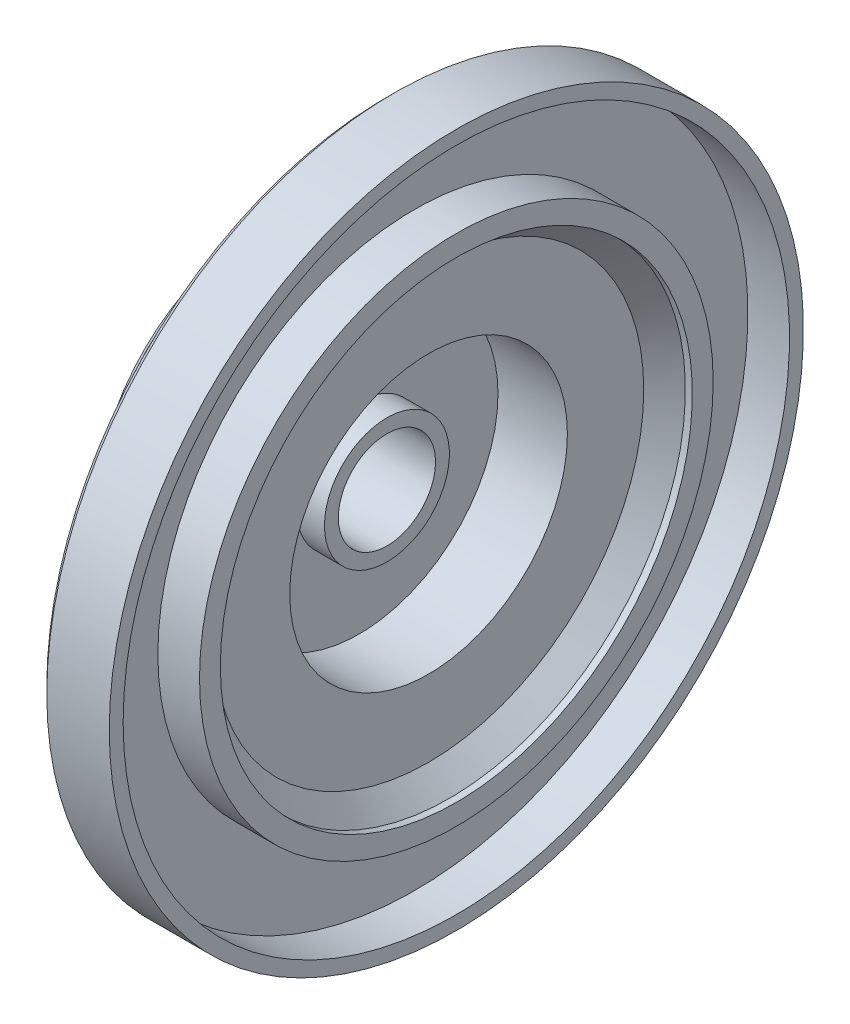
ISO-10303-21;
HEADER;
FILE_DESCRIPTION(('STEP AP214'),'2;1');
FILE_NAME('part.step','',(''),(''),'','','');
FILE_SCHEMA(('AUTOMOTIVE_DESIGN { 1 0 10303 214 1 1 1 1 }'));
ENDSEC;
DATA;
#1=APPLICATION_CONTEXT('core data for automotive mechanical design processes');
#2=APPLICATION_PROTOCOL_DEFINITION('international standard','automotive_design',2000,#1);
#3=PRODUCT_CONTEXT('',#1,'mechanical');
#4=PRODUCT('Part','Part','',(#3));
#5=PRODUCT_RELATED_PRODUCT_CATEGORY('part','',(#4));
#6=PRODUCT_DEFINITION_FORMATION('','',#4);
#7=PRODUCT_DEFINITION_CONTEXT('part definition',#1,'design');
#8=PRODUCT_DEFINITION('design','',#6,#7);
#9=PRODUCT_DEFINITION_SHAPE('','',#8);
#10=(LENGTH_UNIT() NAMED_UNIT(*) SI_UNIT(.MILLI.,.METRE.));
#11=(NAMED_UNIT(*) PLANE_ANGLE_UNIT() SI_UNIT($,.RADIAN.));
#12=(NAMED_UNIT(*) SI_UNIT($,.STERADIAN.) SOLID_ANGLE_UNIT());
#13=UNCERTAINTY_MEASURE_WITH_UNIT(LENGTH_MEASURE(1.E-05),#10,'distance_accuracy_value','');
#14=(GEOMETRIC_REPRESENTATION_CONTEXT(3) GLOBAL_UNCERTAINTY_ASSIGNED_CONTEXT((#13)) GLOBAL_UNIT_ASSIGNED_CONTEXT((#10,
#11,#12)) REPRESENTATION_CONTEXT('',''));
#15=CARTESIAN_POINT('',(0.,0.,0.));
#16=DIRECTION('',(0.,0.,1.));
#17=DIRECTION('',(1.,0.,0.));
#18=AXIS2_PLACEMENT_3D('',#15,#16,#17);
#19=CARTESIAN_POINT('',(0.,0.,0.));
#20=DIRECTION('',(-1.,0.,0.));
#21=DIRECTION('',(0.,0.,1.));
#22=AXIS2_PLACEMENT_3D('',#19,#20,#21);
#23=CYLINDRICAL_SURFACE('',#22,3.5);
#24=CARTESIAN_POINT('',(-17.,0.,0.));
#25=DIRECTION('',(-1.,0.,0.));
#26=DIRECTION('',(0.,0.,1.));
#27=AXIS2_PLACEMENT_3D('',#24,#25,#26);
#28=CIRCLE('',#27,3.5);
#29=CARTESIAN_POINT('',(-17.,0.,3.5));
#30=VERTEX_POINT('',#29);
#31=EDGE_CURVE('E235',#30,#30,#28,.T.);
#32=ORIENTED_EDGE('',*,*,#31,.T.);
#33=EDGE_LOOP('',(#32));
#34=FACE_BOUND('',#33,.T.);
#35=CARTESIAN_POINT('',(-5.,0.,0.));
#36=DIRECTION('',(-1.,0.,0.));
#37=DIRECTION('',(0.,0.,1.));
#38=AXIS2_PLACEMENT_3D('',#35,#36,#37);
#39=CIRCLE('',#38,3.5);
#40=CARTESIAN_POINT('',(-5.,0.,3.5));
#41=VERTEX_POINT('',#40);
#42=EDGE_CURVE('E304',#41,#41,#39,.T.);
#43=ORIENTED_EDGE('',*,*,#42,.F.);
#44=EDGE_LOOP('',(#43));
#45=FACE_BOUND('',#44,.T.);
#46=ADVANCED_FACE('F31',(#34,#45),#23,.F.);
#47=CARTESIAN_POINT('',(-5.,4.5,0.));
#48=DIRECTION('',(1.,0.,0.));
#49=DIRECTION('',(0.,0.,-1.));
#50=AXIS2_PLACEMENT_3D('',#47,#48,#49);
#51=PLANE('',#50);
#52=ORIENTED_EDGE('',*,*,#42,.T.);
#53=EDGE_LOOP('',(#52));
#54=FACE_BOUND('',#53,.T.);
#55=CARTESIAN_POINT('',(-5.,0.,0.));
#56=DIRECTION('',(-1.,0.,0.));
#57=DIRECTION('',(0.,0.,1.));
#58=AXIS2_PLACEMENT_3D('',#55,#56,#57);
#59=CIRCLE('',#58,4.5);
#60=CARTESIAN_POINT('',(-5.,0.,4.5));
#61=VERTEX_POINT('',#60);
#62=EDGE_CURVE('E301',#61,#61,#59,.T.);
#63=ORIENTED_EDGE('',*,*,#62,.F.);
#64=EDGE_LOOP('',(#63));
#65=FACE_BOUND('',#64,.T.);
#66=ADVANCED_FACE('F406',(#54,#65),#51,.T.);
#67=CARTESIAN_POINT('',(0.,0.,0.));
#68=DIRECTION('',(-1.,0.,0.));
#69=DIRECTION('',(0.,0.,1.));
#70=AXIS2_PLACEMENT_3D('',#67,#68,#69);
#71=CYLINDRICAL_SURFACE('',#70,4.5);
#72=CARTESIAN_POINT('',(-7.,0.,0.));
#73=DIRECTION('',(-1.,0.,0.));
#74=DIRECTION('',(0.,0.,1.));
#75=AXIS2_PLACEMENT_3D('',#72,#73,#74);
#76=CIRCLE('',#75,4.5);
#77=CARTESIAN_POINT('',(-7.,0.,4.5));
#78=VERTEX_POINT('',#77);
#79=EDGE_CURVE('E298',#78,#78,#76,.T.);
#80=ORIENTED_EDGE('',*,*,#79,.F.);
#81=EDGE_LOOP('',(#80));
#82=FACE_BOUND('',#81,.T.);
#83=ORIENTED_EDGE('',*,*,#62,.T.);
#84=EDGE_LOOP('',(#83));
#85=FACE_BOUND('',#84,.T.);
#86=ADVANCED_FACE('F411',(#82,#85),#71,.T.);
#87=CARTESIAN_POINT('',(-7.,4.5,0.));
#88=DIRECTION('',(-1.,0.,0.));
#89=DIRECTION('',(0.,0.,1.));
#90=AXIS2_PLACEMENT_3D('',#87,#88,#89);
#91=PLANE('',#90);
#92=CARTESIAN_POINT('',(-7.,0.,0.));
#93=DIRECTION('',(-1.,0.,0.));
#94=DIRECTION('',(0.,0.,1.));
#95=AXIS2_PLACEMENT_3D('',#92,#93,#94);
#96=CIRCLE('',#95,10.);
#97=CARTESIAN_POINT('',(-7.,0.,10.));
#98=VERTEX_POINT('',#97);
#99=EDGE_CURVE('E295',#98,#98,#96,.T.);
#100=ORIENTED_EDGE('',*,*,#99,.F.);
#101=EDGE_LOOP('',(#100));
#102=FACE_BOUND('',#101,.T.);
#103=ORIENTED_EDGE('',*,*,#79,.T.);
#104=EDGE_LOOP('',(#103));
#105=FACE_BOUND('',#104,.T.);
#106=ADVANCED_FACE('F420',(#102,#105),#91,.F.);
#107=CARTESIAN_POINT('',(0.,0.,0.));
#108=DIRECTION('',(-1.,0.,0.));
#109=DIRECTION('',(0.,0.,1.));
#110=AXIS2_PLACEMENT_3D('',#107,#108,#109);
#111=CYLINDRICAL_SURFACE('',#110,10.);
#112=CARTESIAN_POINT('',(-2.,0.,0.));
#113=DIRECTION('',(-1.,0.,0.));
#114=DIRECTION('',(0.,0.,1.));
#115=AXIS2_PLACEMENT_3D('',#112,#113,#114);
#116=CIRCLE('',#115,10.);
#117=CARTESIAN_POINT('',(-2.,0.,10.));
#118=VERTEX_POINT('',#117);
#119=EDGE_CURVE('E292',#118,#118,#116,.T.);
#120=ORIENTED_EDGE('',*,*,#119,.F.);
#121=EDGE_LOOP('',(#120));
#122=FACE_BOUND('',#121,.T.);
#123=ORIENTED_EDGE('',*,*,#99,.T.);
#124=EDGE_LOOP('',(#123));
#125=FACE_BOUND('',#124,.T.);
#126=ADVANCED_FACE('F426',(#122,#125),#111,.F.);
#127=CARTESIAN_POINT('',(-2.,15.5,0.));
#128=DIRECTION('',(1.,0.,0.));
#129=DIRECTION('',(0.,0.,-1.));
#130=AXIS2_PLACEMENT_3D('',#127,#128,#129);
#131=PLANE('',#130);
#132=ORIENTED_EDGE('',*,*,#119,.T.);
#133=EDGE_LOOP('',(#132));
#134=FACE_BOUND('',#133,.T.);
#135=CARTESIAN_POINT('',(-2.,0.,0.));
#136=DIRECTION('',(-1.,0.,0.));
#137=DIRECTION('',(0.,0.,1.));
#138=AXIS2_PLACEMENT_3D('',#135,#136,#137);
#139=CIRCLE('',#138,15.5);
#140=CARTESIAN_POINT('',(-2.,0.,15.5));
#141=VERTEX_POINT('',#140);
#142=EDGE_CURVE('E289',#141,#141,#139,.T.);
#143=ORIENTED_EDGE('',*,*,#142,.F.);
#144=EDGE_LOOP('',(#143));
#145=FACE_BOUND('',#144,.T.);
#146=ADVANCED_FACE('F433',(#134,#145),#131,.T.);
#147=CARTESIAN_POINT('',(-0.50000000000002,0.,0.));
#148=DIRECTION('',(1.,0.,0.));
#149=DIRECTION('',(0.,0.,-1.));
#150=AXIS2_PLACEMENT_3D('',#147,#148,#149);
#151=CONICAL_SURFACE('',#150,17.,0.785398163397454);
#152=ORIENTED_EDGE('',*,*,#142,.T.);
#153=EDGE_LOOP('',(#152));
#154=FACE_BOUND('',#153,.T.);
#155=CARTESIAN_POINT('',(-0.50000000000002,0.,0.));
#156=DIRECTION('',(-1.,0.,0.));
#157=DIRECTION('',(0.,0.,1.));
#158=AXIS2_PLACEMENT_3D('',#155,#156,#157);
#159=CIRCLE('',#158,17.);
#160=CARTESIAN_POINT('',(-0.50000000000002,0.,17.));
#161=VERTEX_POINT('',#160);
#162=EDGE_CURVE('E286',#161,#161,#159,.T.);
#163=ORIENTED_EDGE('',*,*,#162,.F.);
#164=EDGE_LOOP('',(#163));
#165=FACE_BOUND('',#164,.T.);
#166=ADVANCED_FACE('F437',(#154,#165),#151,.F.);
#167=CARTESIAN_POINT('',(0.,0.,0.));
#168=DIRECTION('',(-1.,0.,0.));
#169=DIRECTION('',(0.,0.,1.));
#170=AXIS2_PLACEMENT_3D('',#167,#168,#169);
#171=CYLINDRICAL_SURFACE('',#170,17.);
#172=ORIENTED_EDGE('',*,*,#162,.T.);
#173=EDGE_LOOP('',(#172));
#174=FACE_BOUND('',#173,.T.);
#175=CARTESIAN_POINT('',(0.,0.,0.));
#176=DIRECTION('',(-1.,0.,0.));
#177=DIRECTION('',(0.,0.,1.));
#178=AXIS2_PLACEMENT_3D('',#175,#176,#177);
#179=CIRCLE('',#178,17.);
#180=CARTESIAN_POINT('',(0.,0.,17.));
#181=VERTEX_POINT('',#180);
#182=EDGE_CURVE('E283',#181,#181,#179,.T.);
#183=ORIENTED_EDGE('',*,*,#182,.F.);
#184=EDGE_LOOP('',(#183));
#185=FACE_BOUND('',#184,.T.);
#186=ADVANCED_FACE('F441',(#174,#185),#171,.F.);
#187=CARTESIAN_POINT('',(0.,18.5,0.));
#188=DIRECTION('',(1.,0.,0.));
#189=DIRECTION('',(0.,0.,-1.));
#190=AXIS2_PLACEMENT_3D('',#187,#188,#189);
#191=PLANE('',#190);
#192=ORIENTED_EDGE('',*,*,#182,.T.);
#193=EDGE_LOOP('',(#192));
#194=FACE_BOUND('',#193,.T.);
#195=CARTESIAN_POINT('',(0.,0.,0.));
#196=DIRECTION('',(-1.,0.,0.));
#197=DIRECTION('',(0.,0.,1.));
#198=AXIS2_PLACEMENT_3D('',#195,#196,#197);
#199=CIRCLE('',#198,18.5);
#200=CARTESIAN_POINT('',(0.,0.,18.5));
#201=VERTEX_POINT('',#200);
#202=EDGE_CURVE('E280',#201,#201,#199,.T.);
#203=ORIENTED_EDGE('',*,*,#202,.F.);
#204=EDGE_LOOP('',(#203));
#205=FACE_BOUND('',#204,.T.);
#206=ADVANCED_FACE('F445',(#194,#205),#191,.T.);
#207=CARTESIAN_POINT('',(0.,0.,0.));
#208=DIRECTION('',(-1.,0.,0.));
#209=DIRECTION('',(0.,0.,1.));
#210=AXIS2_PLACEMENT_3D('',#207,#208,#209);
#211=CYLINDRICAL_SURFACE('',#210,18.5);
#212=ORIENTED_EDGE('',*,*,#202,.T.);
#213=EDGE_LOOP('',(#212));
#214=FACE_BOUND('',#213,.T.);
#215=CARTESIAN_POINT('',(-3.,0.,0.));
#216=DIRECTION('',(-1.,0.,0.));
#217=DIRECTION('',(0.,0.,1.));
#218=AXIS2_PLACEMENT_3D('',#215,#216,#217);
#219=CIRCLE('',#218,18.5);
#220=CARTESIAN_POINT('',(-3.,0.,18.5));
#221=VERTEX_POINT('',#220);
#222=EDGE_CURVE('E277',#221,#221,#219,.T.);
#223=ORIENTED_EDGE('',*,*,#222,.F.);
#224=EDGE_LOOP('',(#223));
#225=FACE_BOUND('',#224,.T.);
#226=ADVANCED_FACE('F449',(#214,#225),#211,.T.);
#227=CARTESIAN_POINT('',(-3.,24.,0.));
#228=DIRECTION('',(1.,0.,0.));
#229=DIRECTION('',(0.,0.,-1.));
#230=AXIS2_PLACEMENT_3D('',#227,#228,#229);
#231=PLANE('',#230);
#232=ORIENTED_EDGE('',*,*,#222,.T.);
#233=EDGE_LOOP('',(#232));
#234=FACE_BOUND('',#233,.T.);
#235=CARTESIAN_POINT('',(-3.,0.,0.));
#236=DIRECTION('',(-1.,0.,0.));
#237=DIRECTION('',(0.,0.,1.));
#238=AXIS2_PLACEMENT_3D('',#235,#236,#237);
#239=CIRCLE('',#238,24.);
#240=CARTESIAN_POINT('',(-3.,0.,24.));
#241=VERTEX_POINT('',#240);
#242=EDGE_CURVE('E274',#241,#241,#239,.T.);
#243=ORIENTED_EDGE('',*,*,#242,.F.);
#244=EDGE_LOOP('',(#243));
#245=FACE_BOUND('',#244,.T.);
#246=ADVANCED_FACE('F453',(#234,#245),#231,.T.);
#247=CARTESIAN_POINT('',(0.,0.,0.));
#248=DIRECTION('',(-1.,0.,0.));
#249=DIRECTION('',(0.,0.,1.));
#250=AXIS2_PLACEMENT_3D('',#247,#248,#249);
#251=CYLINDRICAL_SURFACE('',#250,24.);
#252=ORIENTED_EDGE('',*,*,#242,.T.);
#253=EDGE_LOOP('',(#252));
#254=FACE_BOUND('',#253,.T.);
#255=CARTESIAN_POINT('',(0.,0.,0.));
#256=DIRECTION('',(-1.,0.,0.));
#257=DIRECTION('',(0.,0.,1.));
#258=AXIS2_PLACEMENT_3D('',#255,#256,#257);
#259=CIRCLE('',#258,24.);
#260=CARTESIAN_POINT('',(0.,0.,24.));
#261=VERTEX_POINT('',#260);
#262=EDGE_CURVE('E271',#261,#261,#259,.T.);
#263=ORIENTED_EDGE('',*,*,#262,.F.);
#264=EDGE_LOOP('',(#263));
#265=FACE_BOUND('',#264,.T.);
#266=ADVANCED_FACE('F457',(#254,#265),#251,.F.);
#267=CARTESIAN_POINT('',(0.,24.,0.));
#268=DIRECTION('',(-1.,0.,0.));
#269=DIRECTION('',(0.,0.,1.));
#270=AXIS2_PLACEMENT_3D('',#267,#268,#269);
#271=PLANE('',#270);
#272=CARTESIAN_POINT('',(0.,0.,0.));
#273=DIRECTION('',(-1.,0.,0.));
#274=DIRECTION('',(0.,0.,1.));
#275=AXIS2_PLACEMENT_3D('',#272,#273,#274);
#276=CIRCLE('',#275,25.);
#277=CARTESIAN_POINT('',(0.,0.,25.));
#278=VERTEX_POINT('',#277);
#279=EDGE_CURVE('E268',#278,#278,#276,.T.);
#280=ORIENTED_EDGE('',*,*,#279,.F.);
#281=EDGE_LOOP('',(#280));
#282=FACE_BOUND('',#281,.T.);
#283=ORIENTED_EDGE('',*,*,#262,.T.);
#284=EDGE_LOOP('',(#283));
#285=FACE_BOUND('',#284,.T.);
#286=ADVANCED_FACE('F461',(#282,#285),#271,.F.);
#287=CARTESIAN_POINT('',(0.,0.,0.));
#288=DIRECTION('',(-1.,0.,0.));
#289=DIRECTION('',(0.,0.,1.));
#290=AXIS2_PLACEMENT_3D('',#287,#288,#289);
#291=CYLINDRICAL_SURFACE('',#290,25.);
#292=CARTESIAN_POINT('',(-4.5,0.,0.));
#293=DIRECTION('',(-1.,0.,0.));
#294=DIRECTION('',(0.,0.,1.));
#295=AXIS2_PLACEMENT_3D('',#292,#293,#294);
#296=CIRCLE('',#295,25.);
#297=CARTESIAN_POINT('',(-4.5,0.,25.));
#298=VERTEX_POINT('',#297);
#299=EDGE_CURVE('E265',#298,#298,#296,.T.);
#300=ORIENTED_EDGE('',*,*,#299,.F.);
#301=EDGE_LOOP('',(#300));
#302=FACE_BOUND('',#301,.T.);
#303=ORIENTED_EDGE('',*,*,#279,.T.);
#304=EDGE_LOOP('',(#303));
#305=FACE_BOUND('',#304,.T.);
#306=ADVANCED_FACE('F465',(#302,#305),#291,.T.);
#307=CARTESIAN_POINT('',(-5.,0.,0.));
#308=DIRECTION('',(1.,0.,0.));
#309=DIRECTION('',(0.,0.,-1.));
#310=AXIS2_PLACEMENT_3D('',#307,#308,#309);
#311=CONICAL_SURFACE('',#310,24.5,0.785398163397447);
#312=ORIENTED_EDGE('',*,*,#299,.T.);
#313=EDGE_LOOP('',(#312));
#314=FACE_BOUND('',#313,.T.);
#315=CARTESIAN_POINT('',(-5.,0.,0.));
#316=DIRECTION('',(-1.,0.,0.));
#317=DIRECTION('',(0.,0.,1.));
#318=AXIS2_PLACEMENT_3D('',#315,#316,#317);
#319=CIRCLE('',#318,24.5);
#320=CARTESIAN_POINT('',(-5.,0.,24.5));
#321=VERTEX_POINT('',#320);
#322=EDGE_CURVE('E262',#321,#321,#319,.T.);
#323=ORIENTED_EDGE('',*,*,#322,.F.);
#324=EDGE_LOOP('',(#323));
#325=FACE_BOUND('',#324,.T.);
#326=ADVANCED_FACE('F469',(#314,#325),#311,.T.);
#327=CARTESIAN_POINT('',(-5.,19.25,0.));
#328=DIRECTION('',(-1.,0.,0.));
#329=DIRECTION('',(0.,0.,1.));
#330=AXIS2_PLACEMENT_3D('',#327,#328,#329);
#331=PLANE('',#330);
#332=CARTESIAN_POINT('',(-5.,-10.9999999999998,-19.0525588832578));
#333=DIRECTION('',(-1.,0.,0.));
#334=DIRECTION('',(0.,0.866025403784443,-0.499999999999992));
#335=AXIS2_PLACEMENT_3D('',#332,#333,#334);
#336=CIRCLE('',#335,2.00000000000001);
#337=CARTESIAN_POINT('',(-5.,-9.99999999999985,-17.3205080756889));
#338=VERTEX_POINT('',#337);
#339=CARTESIAN_POINT('',(-5.,-11.9999999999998,-20.7846096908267));
#340=VERTEX_POINT('',#339);
#341=EDGE_CURVE('E158',#338,#340,#336,.T.);
#342=ORIENTED_EDGE('',*,*,#341,.F.);
#343=CARTESIAN_POINT('',(-5.,0.,0.));
#344=DIRECTION('',(-1.,0.,0.));
#345=DIRECTION('',(0.,0.866025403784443,-0.499999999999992));
#346=AXIS2_PLACEMENT_3D('',#343,#344,#345);
#347=CIRCLE('',#346,20.);
#348=CARTESIAN_POINT('',(-5.,-15.3190982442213,12.8578858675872));
#349=VERTEX_POINT('',#348);
#350=EDGE_CURVE('E164',#338,#349,#347,.T.);
#351=ORIENTED_EDGE('',*,*,#350,.T.);
#352=CARTESIAN_POINT('',(-5.,-16.8510080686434,14.1436744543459));
#353=DIRECTION('',(-1.,0.,0.));
#354=DIRECTION('',(0.,0.866025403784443,-0.499999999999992));
#355=AXIS2_PLACEMENT_3D('',#352,#353,#354);
#356=CIRCLE('',#355,2.00000000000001);
#357=CARTESIAN_POINT('',(-5.,-18.3829178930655,15.4294630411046));
#358=VERTEX_POINT('',#357);
#359=EDGE_CURVE('E180',#358,#349,#356,.T.);
#360=ORIENTED_EDGE('',*,*,#359,.F.);
#361=CARTESIAN_POINT('',(-5.,0.,0.));
#362=DIRECTION('',(-1.,0.,0.));
#363=DIRECTION('',(0.,0.866025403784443,-0.499999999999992));
#364=AXIS2_PLACEMENT_3D('',#361,#362,#363);
#365=CIRCLE('',#364,24.);
#366=EDGE_CURVE('E177',#340,#358,#365,.T.);
#367=ORIENTED_EDGE('',*,*,#366,.F.);
#368=EDGE_LOOP('',(#342,#351,#360,#367));
#369=FACE_BOUND('',#368,.T.);
#370=CARTESIAN_POINT('',(-5.,-11.0000000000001,19.0525588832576));
#371=DIRECTION('',(-1.,0.,0.));
#372=DIRECTION('',(0.,-0.866025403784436,-0.500000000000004));
#373=AXIS2_PLACEMENT_3D('',#370,#371,#372);
#374=CIRCLE('',#373,2.00000000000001);
#375=CARTESIAN_POINT('',(-5.,-10.0000000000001,17.3205080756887));
#376=VERTEX_POINT('',#375);
#377=CARTESIAN_POINT('',(-5.,-12.0000000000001,20.7846096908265));
#378=VERTEX_POINT('',#377);
#379=EDGE_CURVE('E185',#376,#378,#374,.T.);
#380=ORIENTED_EDGE('',*,*,#379,.F.);
#381=CARTESIAN_POINT('',(-5.,0.,0.));
#382=DIRECTION('',(-1.,0.,0.));
#383=DIRECTION('',(0.,-0.866025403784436,-0.500000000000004));
#384=AXIS2_PLACEMENT_3D('',#381,#382,#383);
#385=CIRCLE('',#384,20.);
#386=CARTESIAN_POINT('',(-5.,18.7948049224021,6.83778530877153));
#387=VERTEX_POINT('',#386);
#388=EDGE_CURVE('E194',#376,#387,#385,.T.);
#389=ORIENTED_EDGE('',*,*,#388,.T.);
#390=CARTESIAN_POINT('',(-5.,20.6742854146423,7.52156383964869));
#391=DIRECTION('',(-1.,0.,0.));
#392=DIRECTION('',(0.,-0.866025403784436,-0.500000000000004));
#393=AXIS2_PLACEMENT_3D('',#390,#391,#392);
#394=CIRCLE('',#393,2.00000000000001);
#395=CARTESIAN_POINT('',(-5.,22.5537659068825,8.20534237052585));
#396=VERTEX_POINT('',#395);
#397=EDGE_CURVE('E191',#396,#387,#394,.T.);
#398=ORIENTED_EDGE('',*,*,#397,.F.);
#399=CARTESIAN_POINT('',(-5.,0.,0.));
#400=DIRECTION('',(-1.,0.,0.));
#401=DIRECTION('',(0.,-0.866025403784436,-0.500000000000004));
#402=AXIS2_PLACEMENT_3D('',#399,#400,#401);
#403=CIRCLE('',#402,24.);
#404=EDGE_CURVE('E188',#378,#396,#403,.T.);
#405=ORIENTED_EDGE('',*,*,#404,.F.);
#406=EDGE_LOOP('',(#380,#389,#398,#405));
#407=FACE_BOUND('',#406,.T.);
#408=CARTESIAN_POINT('',(-5.,22.,0.));
#409=DIRECTION('',(-1.,0.,0.));
#410=DIRECTION('',(0.,0.,1.));
#411=AXIS2_PLACEMENT_3D('',#408,#409,#410);
#412=CIRCLE('',#411,2.00000000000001);
#413=CARTESIAN_POINT('',(-5.,20.,0.));
#414=VERTEX_POINT('',#413);
#415=CARTESIAN_POINT('',(-5.,24.,0.));
#416=VERTEX_POINT('',#415);
#417=EDGE_CURVE('E215',#414,#416,#412,.T.);
#418=ORIENTED_EDGE('',*,*,#417,.F.);
#419=CARTESIAN_POINT('',(-5.,0.,0.));
#420=DIRECTION('',(-1.,0.,0.));
#421=DIRECTION('',(0.,0.,1.));
#422=AXIS2_PLACEMENT_3D('',#419,#420,#421);
#423=CIRCLE('',#422,20.);
#424=CARTESIAN_POINT('',(-5.,-3.47570667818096,-19.6956711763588));
#425=VERTEX_POINT('',#424);
#426=EDGE_CURVE('E224',#414,#425,#423,.T.);
#427=ORIENTED_EDGE('',*,*,#426,.T.);
#428=CARTESIAN_POINT('',(-5.,-3.82327734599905,-21.6652382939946));
#429=DIRECTION('',(-1.,0.,0.));
#430=DIRECTION('',(0.,0.,1.));
#431=AXIS2_PLACEMENT_3D('',#428,#429,#430);
#432=CIRCLE('',#431,2.00000000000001);
#433=CARTESIAN_POINT('',(-5.,-4.17084801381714,-23.6348054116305));
#434=VERTEX_POINT('',#433);
#435=EDGE_CURVE('E221',#434,#425,#432,.T.);
#436=ORIENTED_EDGE('',*,*,#435,.F.);
#437=CARTESIAN_POINT('',(-5.,0.,0.));
#438=DIRECTION('',(-1.,0.,0.));
#439=DIRECTION('',(0.,0.,1.));
#440=AXIS2_PLACEMENT_3D('',#437,#438,#439);
#441=CIRCLE('',#440,24.);
#442=EDGE_CURVE('E218',#416,#434,#441,.T.);
#443=ORIENTED_EDGE('',*,*,#442,.F.);
#444=EDGE_LOOP('',(#418,#427,#436,#443));
#445=FACE_BOUND('',#444,.T.);
#446=ORIENTED_EDGE('',*,*,#322,.T.);
#447=EDGE_LOOP('',(#446));
#448=FACE_BOUND('',#447,.T.);
#449=CARTESIAN_POINT('',(-5.,0.,0.));
#450=DIRECTION('',(-1.,0.,0.));
#451=DIRECTION('',(0.,0.,1.));
#452=AXIS2_PLACEMENT_3D('',#449,#450,#451);
#453=CIRCLE('',#452,19.25);
#454=CARTESIAN_POINT('',(-5.,0.,19.25));
#455=VERTEX_POINT('',#454);
#456=EDGE_CURVE('E259',#455,#455,#453,.T.);
#457=ORIENTED_EDGE('',*,*,#456,.F.);
#458=EDGE_LOOP('',(#457));
#459=FACE_BOUND('',#458,.T.);
#460=ADVANCED_FACE('F174',(#369,#407,#445,#448,#459),#331,.T.);
#461=CARTESIAN_POINT('',(-5.,0.,0.));
#462=DIRECTION('',(-1.,0.,0.));
#463=DIRECTION('',(0.,0.,1.));
#464=AXIS2_PLACEMENT_3D('',#461,#462,#463);
#465=CONICAL_SURFACE('',#464,19.25,0.785398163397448);
#466=CARTESIAN_POINT('',(-4.75,0.,0.));
#467=DIRECTION('',(-1.,0.,0.));
#468=DIRECTION('',(0.,0.,1.));
#469=AXIS2_PLACEMENT_3D('',#466,#467,#468);
#470=CIRCLE('',#469,19.);
#471=CARTESIAN_POINT('',(-4.75,0.,19.));
#472=VERTEX_POINT('',#471);
#473=EDGE_CURVE('E256',#472,#472,#470,.T.);
#474=ORIENTED_EDGE('',*,*,#473,.F.);
#475=EDGE_LOOP('',(#474));
#476=FACE_BOUND('',#475,.T.);
#477=ORIENTED_EDGE('',*,*,#456,.T.);
#478=EDGE_LOOP('',(#477));
#479=FACE_BOUND('',#478,.T.);
#480=ADVANCED_FACE('F476',(#476,#479),#465,.F.);
#481=CARTESIAN_POINT('',(-4.75,19.,0.));
#482=DIRECTION('',(1.,0.,0.));
#483=DIRECTION('',(0.,0.,-1.));
#484=AXIS2_PLACEMENT_3D('',#481,#482,#483);
#485=PLANE('',#484);
#486=CARTESIAN_POINT('',(-4.75,0.,0.));
#487=DIRECTION('',(-1.,0.,0.));
#488=DIRECTION('',(0.,0.,1.));
#489=AXIS2_PLACEMENT_3D('',#486,#487,#488);
#490=CIRCLE('',#489,12.5);
#491=CARTESIAN_POINT('',(-4.75,0.,12.5));
#492=VERTEX_POINT('',#491);
#493=EDGE_CURVE('E253',#492,#492,#490,.T.);
#494=ORIENTED_EDGE('',*,*,#493,.F.);
#495=EDGE_LOOP('',(#494));
#496=FACE_BOUND('',#495,.T.);
#497=ORIENTED_EDGE('',*,*,#473,.T.);
#498=EDGE_LOOP('',(#497));
#499=FACE_BOUND('',#498,.T.);
#500=ADVANCED_FACE('F479',(#496,#499),#485,.F.);
#501=CARTESIAN_POINT('',(0.,0.,0.));
#502=DIRECTION('',(-1.,0.,0.));
#503=DIRECTION('',(0.,0.,1.));
#504=AXIS2_PLACEMENT_3D('',#501,#502,#503);
#505=CYLINDRICAL_SURFACE('',#504,12.5);
#506=ORIENTED_EDGE('',*,*,#493,.T.);
#507=EDGE_LOOP('',(#506));
#508=FACE_BOUND('',#507,.T.);
#509=CARTESIAN_POINT('',(-13.5,0.,0.));
#510=DIRECTION('',(-1.,0.,0.));
#511=DIRECTION('',(0.,0.,1.));
#512=AXIS2_PLACEMENT_3D('',#509,#510,#511);
#513=CIRCLE('',#512,12.5);
#514=CARTESIAN_POINT('',(-13.5,0.,12.5));
#515=VERTEX_POINT('',#514);
#516=EDGE_CURVE('E250',#515,#515,#513,.T.);
#517=ORIENTED_EDGE('',*,*,#516,.F.);
#518=EDGE_LOOP('',(#517));
#519=FACE_BOUND('',#518,.T.);
#520=ADVANCED_FACE('F483',(#508,#519),#505,.T.);
#521=CARTESIAN_POINT('',(-14.,0.,0.));
#522=DIRECTION('',(1.,0.,0.));
#523=DIRECTION('',(0.,0.,-1.));
#524=AXIS2_PLACEMENT_3D('',#521,#522,#523);
#525=CONICAL_SURFACE('',#524,12.,0.785398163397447);
#526=ORIENTED_EDGE('',*,*,#516,.T.);
#527=EDGE_LOOP('',(#526));
#528=FACE_BOUND('',#527,.T.);
#529=CARTESIAN_POINT('',(-14.,0.,0.));
#530=DIRECTION('',(-1.,0.,0.));
#531=DIRECTION('',(0.,0.,1.));
#532=AXIS2_PLACEMENT_3D('',#529,#530,#531);
#533=CIRCLE('',#532,12.);
#534=CARTESIAN_POINT('',(-14.,0.,12.));
#535=VERTEX_POINT('',#534);
#536=EDGE_CURVE('E247',#535,#535,#533,.T.);
#537=ORIENTED_EDGE('',*,*,#536,.F.);
#538=EDGE_LOOP('',(#537));
#539=FACE_BOUND('',#538,.T.);
#540=ADVANCED_FACE('F487',(#528,#539),#525,.T.);
#541=CARTESIAN_POINT('',(-14.,7.,0.));
#542=DIRECTION('',(-1.,0.,0.));
#543=DIRECTION('',(0.,0.,1.));
#544=AXIS2_PLACEMENT_3D('',#541,#542,#543);
#545=PLANE('',#544);
#546=ORIENTED_EDGE('',*,*,#536,.T.);
#547=EDGE_LOOP('',(#546));
#548=FACE_BOUND('',#547,.T.);
#549=CARTESIAN_POINT('',(-14.,0.,0.));
#550=DIRECTION('',(-1.,0.,0.));
#551=DIRECTION('',(0.,0.,1.));
#552=AXIS2_PLACEMENT_3D('',#549,#550,#551);
#553=CIRCLE('',#552,7.);
#554=CARTESIAN_POINT('',(-14.,0.,7.));
#555=VERTEX_POINT('',#554);
#556=EDGE_CURVE('E244',#555,#555,#553,.T.);
#557=ORIENTED_EDGE('',*,*,#556,.F.);
#558=EDGE_LOOP('',(#557));
#559=FACE_BOUND('',#558,.T.);
#560=ADVANCED_FACE('F491',(#548,#559),#545,.T.);
#561=CARTESIAN_POINT('',(0.,0.,0.));
#562=DIRECTION('',(-1.,0.,0.));
#563=DIRECTION('',(0.,0.,1.));
#564=AXIS2_PLACEMENT_3D('',#561,#562,#563);
#565=CYLINDRICAL_SURFACE('',#564,7.);
#566=ORIENTED_EDGE('',*,*,#556,.T.);
#567=EDGE_LOOP('',(#566));
#568=FACE_BOUND('',#567,.T.);
#569=CARTESIAN_POINT('',(-16.,0.,0.));
#570=DIRECTION('',(-1.,0.,0.));
#571=DIRECTION('',(0.,0.,1.));
#572=AXIS2_PLACEMENT_3D('',#569,#570,#571);
#573=CIRCLE('',#572,7.);
#574=CARTESIAN_POINT('',(-16.,0.,7.));
#575=VERTEX_POINT('',#574);
#576=EDGE_CURVE('E241',#575,#575,#573,.T.);
#577=ORIENTED_EDGE('',*,*,#576,.F.);
#578=EDGE_LOOP('',(#577));
#579=FACE_BOUND('',#578,.T.);
#580=ADVANCED_FACE('F495',(#568,#579),#565,.T.);
#581=CARTESIAN_POINT('',(-17.,0.,0.));
#582=DIRECTION('',(1.,0.,0.));
#583=DIRECTION('',(0.,0.,-1.));
#584=AXIS2_PLACEMENT_3D('',#581,#582,#583);
#585=CONICAL_SURFACE('',#584,5.99999999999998,0.785398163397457);
#586=ORIENTED_EDGE('',*,*,#576,.T.);
#587=EDGE_LOOP('',(#586));
#588=FACE_BOUND('',#587,.T.);
#589=CARTESIAN_POINT('',(-17.,0.,0.));
#590=DIRECTION('',(-1.,0.,0.));
#591=DIRECTION('',(0.,0.,1.));
#592=AXIS2_PLACEMENT_3D('',#589,#590,#591);
#593=CIRCLE('',#592,5.99999999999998);
#594=CARTESIAN_POINT('',(-17.,0.,5.99999999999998));
#595=VERTEX_POINT('',#594);
#596=EDGE_CURVE('E238',#595,#595,#593,.T.);
#597=ORIENTED_EDGE('',*,*,#596,.F.);
#598=EDGE_LOOP('',(#597));
#599=FACE_BOUND('',#598,.T.);
#600=ADVANCED_FACE('F499',(#588,#599),#585,.T.);
#601=CARTESIAN_POINT('',(-17.,3.5,0.));
#602=DIRECTION('',(-1.,0.,0.));
#603=DIRECTION('',(0.,0.,1.));
#604=AXIS2_PLACEMENT_3D('',#601,#602,#603);
#605=PLANE('',#604);
#606=ORIENTED_EDGE('',*,*,#596,.T.);
#607=EDGE_LOOP('',(#606));
#608=FACE_BOUND('',#607,.T.);
#609=ORIENTED_EDGE('',*,*,#31,.F.);
#610=EDGE_LOOP('',(#609));
#611=FACE_BOUND('',#610,.T.);
#612=ADVANCED_FACE('F503',(#608,#611),#605,.T.);
#613=CARTESIAN_POINT('',(-3.5,22.,0.));
#614=DIRECTION('',(-1.,0.,0.));
#615=DIRECTION('',(0.,0.,1.));
#616=AXIS2_PLACEMENT_3D('',#613,#614,#615);
#617=CYLINDRICAL_SURFACE('',#616,2.00000000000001);
#618=DIRECTION('',(-1.,0.,0.));
#619=VECTOR('',#618,1.);
#620=CARTESIAN_POINT('',(-3.5,24.,0.));
#621=LINE('',#620,#619);
#622=CARTESIAN_POINT('',(-4.5,24.,0.));
#623=VERTEX_POINT('',#622);
#624=EDGE_CURVE('E227',#623,#416,#621,.T.);
#625=ORIENTED_EDGE('',*,*,#624,.F.);
#626=CARTESIAN_POINT('',(-4.5,22.,0.));
#627=DIRECTION('',(-1.,0.,0.));
#628=DIRECTION('',(0.,0.,1.));
#629=AXIS2_PLACEMENT_3D('',#626,#627,#628);
#630=CIRCLE('',#629,2.00000000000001);
#631=CARTESIAN_POINT('',(-4.5,20.,0.));
#632=VERTEX_POINT('',#631);
#633=EDGE_CURVE('E323',#623,#632,#630,.F.);
#634=ORIENTED_EDGE('',*,*,#633,.T.);
#635=DIRECTION('',(-1.,0.,0.));
#636=VECTOR('',#635,1.);
#637=CARTESIAN_POINT('',(-3.5,20.,0.));
#638=LINE('',#637,#636);
#639=EDGE_CURVE('E233',#632,#414,#638,.T.);
#640=ORIENTED_EDGE('',*,*,#639,.T.);
#641=ORIENTED_EDGE('',*,*,#417,.T.);
#642=EDGE_LOOP('',(#625,#634,#640,#641));
#643=FACE_BOUND('',#642,.T.);
#644=ADVANCED_FACE('F507',(#643),#617,.F.);
#645=CARTESIAN_POINT('',(-3.5,0.,0.));
#646=DIRECTION('',(-1.,0.,0.));
#647=DIRECTION('',(0.,0.,1.));
#648=AXIS2_PLACEMENT_3D('',#645,#646,#647);
#649=CYLINDRICAL_SURFACE('',#648,20.);
#650=ORIENTED_EDGE('',*,*,#639,.F.);
#651=CARTESIAN_POINT('',(-4.5,0.,0.));
#652=DIRECTION('',(-1.,0.,0.));
#653=DIRECTION('',(0.,0.,1.));
#654=AXIS2_PLACEMENT_3D('',#651,#652,#653);
#655=CIRCLE('',#654,20.);
#656=CARTESIAN_POINT('',(-4.5,-3.47570667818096,-19.6956711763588));
#657=VERTEX_POINT('',#656);
#658=EDGE_CURVE('E307',#632,#657,#655,.T.);
#659=ORIENTED_EDGE('',*,*,#658,.T.);
#660=DIRECTION('',(-1.,0.,0.));
#661=VECTOR('',#660,1.);
#662=CARTESIAN_POINT('',(-3.5,-3.47570667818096,-19.6956711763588));
#663=LINE('',#662,#661);
#664=EDGE_CURVE('E231',#657,#425,#663,.T.);
#665=ORIENTED_EDGE('',*,*,#664,.T.);
#666=ORIENTED_EDGE('',*,*,#426,.F.);
#667=EDGE_LOOP('',(#650,#659,#665,#666));
#668=FACE_BOUND('',#667,.T.);
#669=ADVANCED_FACE('F509',(#668),#649,.T.);
#670=CARTESIAN_POINT('',(-3.5,-3.82327734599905,-21.6652382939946));
#671=DIRECTION('',(-1.,0.,0.));
#672=DIRECTION('',(0.,0.,1.));
#673=AXIS2_PLACEMENT_3D('',#670,#671,#672);
#674=CYLINDRICAL_SURFACE('',#673,2.00000000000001);
#675=ORIENTED_EDGE('',*,*,#664,.F.);
#676=CARTESIAN_POINT('',(-4.5,-3.82327734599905,-21.6652382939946));
#677=DIRECTION('',(-1.,0.,0.));
#678=DIRECTION('',(0.,0.,1.));
#679=AXIS2_PLACEMENT_3D('',#676,#677,#678);
#680=CIRCLE('',#679,2.00000000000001);
#681=CARTESIAN_POINT('',(-4.5,-4.17084801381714,-23.6348054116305));
#682=VERTEX_POINT('',#681);
#683=EDGE_CURVE('E319',#657,#682,#680,.F.);
#684=ORIENTED_EDGE('',*,*,#683,.T.);
#685=DIRECTION('',(-1.,0.,0.));
#686=VECTOR('',#685,1.);
#687=CARTESIAN_POINT('',(-3.5,-4.17084801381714,-23.6348054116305));
#688=LINE('',#687,#686);
#689=EDGE_CURVE('E229',#682,#434,#688,.T.);
#690=ORIENTED_EDGE('',*,*,#689,.T.);
#691=ORIENTED_EDGE('',*,*,#435,.T.);
#692=EDGE_LOOP('',(#675,#684,#690,#691));
#693=FACE_BOUND('',#692,.T.);
#694=ADVANCED_FACE('F512',(#693),#674,.F.);
#695=CARTESIAN_POINT('',(-3.5,0.,0.));
#696=DIRECTION('',(-1.,0.,0.));
#697=DIRECTION('',(0.,0.,1.));
#698=AXIS2_PLACEMENT_3D('',#695,#696,#697);
#699=CYLINDRICAL_SURFACE('',#698,24.);
#700=ORIENTED_EDGE('',*,*,#689,.F.);
#701=CARTESIAN_POINT('',(-4.5,0.,0.));
#702=DIRECTION('',(-1.,0.,0.));
#703=DIRECTION('',(0.,0.,1.));
#704=AXIS2_PLACEMENT_3D('',#701,#702,#703);
#705=CIRCLE('',#704,24.);
#706=EDGE_CURVE('E321',#682,#623,#705,.F.);
#707=ORIENTED_EDGE('',*,*,#706,.T.);
#708=ORIENTED_EDGE('',*,*,#624,.T.);
#709=ORIENTED_EDGE('',*,*,#442,.T.);
#710=EDGE_LOOP('',(#700,#707,#708,#709));
#711=FACE_BOUND('',#710,.T.);
#712=ADVANCED_FACE('F516',(#711),#699,.F.);
#713=CARTESIAN_POINT('',(-3.5,11.,0.));
#714=DIRECTION('',(-1.,0.,0.));
#715=DIRECTION('',(0.,0.,1.));
#716=AXIS2_PLACEMENT_3D('',#713,#714,#715);
#717=PLANE('',#716);
#718=CARTESIAN_POINT('',(-3.5,-3.82327734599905,-21.6652382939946));
#719=DIRECTION('',(-1.,0.,0.));
#720=DIRECTION('',(0.,0.,1.));
#721=AXIS2_PLACEMENT_3D('',#718,#719,#720);
#722=CIRCLE('',#721,1.00000000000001);
#723=CARTESIAN_POINT('',(-3.5,-3.9970626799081,-22.6500218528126));
#724=VERTEX_POINT('',#723);
#725=CARTESIAN_POINT('',(-3.5,-3.64949201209,-20.6804547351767));
#726=VERTEX_POINT('',#725);
#727=EDGE_CURVE('E314',#724,#726,#722,.T.);
#728=ORIENTED_EDGE('',*,*,#727,.T.);
#729=CARTESIAN_POINT('',(-3.5,0.,0.));
#730=DIRECTION('',(-1.,0.,0.));
#731=DIRECTION('',(0.,0.,1.));
#732=AXIS2_PLACEMENT_3D('',#729,#730,#731);
#733=CIRCLE('',#732,21.);
#734=CARTESIAN_POINT('',(-3.5,21.,0.));
#735=VERTEX_POINT('',#734);
#736=EDGE_CURVE('E316',#726,#735,#733,.F.);
#737=ORIENTED_EDGE('',*,*,#736,.T.);
#738=CARTESIAN_POINT('',(-3.5,22.,0.));
#739=DIRECTION('',(-1.,0.,0.));
#740=DIRECTION('',(0.,0.,1.));
#741=AXIS2_PLACEMENT_3D('',#738,#739,#740);
#742=CIRCLE('',#741,1.00000000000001);
#743=CARTESIAN_POINT('',(-3.5,23.,0.));
#744=VERTEX_POINT('',#743);
#745=EDGE_CURVE('E310',#735,#744,#742,.T.);
#746=ORIENTED_EDGE('',*,*,#745,.T.);
#747=CARTESIAN_POINT('',(-3.5,0.,0.));
#748=DIRECTION('',(-1.,0.,0.));
#749=DIRECTION('',(0.,0.,1.));
#750=AXIS2_PLACEMENT_3D('',#747,#748,#749);
#751=CIRCLE('',#750,23.);
#752=EDGE_CURVE('E312',#744,#724,#751,.T.);
#753=ORIENTED_EDGE('',*,*,#752,.T.);
#754=EDGE_LOOP('',(#728,#737,#746,#753));
#755=FACE_BOUND('',#754,.T.);
#756=ADVANCED_FACE('F518',(#755),#717,.T.);
#757=CARTESIAN_POINT('',(-4.5,0.,0.));
#758=DIRECTION('',(-1.,0.,0.));
#759=DIRECTION('',(0.,0.,1.));
#760=AXIS2_PLACEMENT_3D('',#757,#758,#759);
#761=TOROIDAL_SURFACE('',#760,23.,1.);
#762=CARTESIAN_POINT('',(-4.5,-3.9970626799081,-22.6500218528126));
#763=DIRECTION('',(0.,0.984783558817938,-0.173785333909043));
#764=DIRECTION('',(0.,0.173785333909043,0.984783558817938));
#765=AXIS2_PLACEMENT_3D('',#762,#763,#764);
#766=CIRCLE('',#765,1.);
#767=EDGE_CURVE('E209',#724,#682,#766,.T.);
#768=ORIENTED_EDGE('',*,*,#767,.F.);
#769=ORIENTED_EDGE('',*,*,#752,.F.);
#770=CARTESIAN_POINT('',(-4.5,23.,0.));
#771=DIRECTION('',(0.,0.,-1.));
#772=DIRECTION('',(0.,1.,0.));
#773=AXIS2_PLACEMENT_3D('',#770,#771,#772);
#774=CIRCLE('',#773,1.);
#775=EDGE_CURVE('E212',#623,#744,#774,.T.);
#776=ORIENTED_EDGE('',*,*,#775,.F.);
#777=ORIENTED_EDGE('',*,*,#706,.F.);
#778=EDGE_LOOP('',(#768,#769,#776,#777));
#779=FACE_BOUND('',#778,.T.);
#780=ADVANCED_FACE('F522',(#779),#761,.F.);
#781=CARTESIAN_POINT('',(-4.5,22.,0.));
#782=DIRECTION('',(-1.,0.,0.));
#783=DIRECTION('',(0.,0.,1.));
#784=AXIS2_PLACEMENT_3D('',#781,#782,#783);
#785=TOROIDAL_SURFACE('',#784,1.00000000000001,1.);
#786=ORIENTED_EDGE('',*,*,#775,.T.);
#787=ORIENTED_EDGE('',*,*,#745,.F.);
#788=CARTESIAN_POINT('',(-4.5,21.,0.));
#789=DIRECTION('',(0.,0.,1.));
#790=DIRECTION('',(1.,0.,0.));
#791=AXIS2_PLACEMENT_3D('',#788,#789,#790);
#792=CIRCLE('',#791,1.);
#793=EDGE_CURVE('E207',#632,#735,#792,.T.);
#794=ORIENTED_EDGE('',*,*,#793,.F.);
#795=ORIENTED_EDGE('',*,*,#633,.F.);
#796=EDGE_LOOP('',(#786,#787,#794,#795));
#797=FACE_BOUND('',#796,.T.);
#798=ADVANCED_FACE('F531',(#797),#785,.F.);
#799=CARTESIAN_POINT('',(-4.5,-3.82327734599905,-21.6652382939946));
#800=DIRECTION('',(-1.,0.,0.));
#801=DIRECTION('',(0.,0.,1.));
#802=AXIS2_PLACEMENT_3D('',#799,#800,#801);
#803=TOROIDAL_SURFACE('',#802,1.00000000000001,1.);
#804=ORIENTED_EDGE('',*,*,#767,.T.);
#805=ORIENTED_EDGE('',*,*,#683,.F.);
#806=CARTESIAN_POINT('',(-4.5,-3.64949201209,-20.6804547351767));
#807=DIRECTION('',(0.,-0.984783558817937,0.173785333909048));
#808=DIRECTION('',(0.,-0.173785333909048,-0.984783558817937));
#809=AXIS2_PLACEMENT_3D('',#806,#807,#808);
#810=CIRCLE('',#809,1.);
#811=EDGE_CURVE('E205',#726,#657,#810,.T.);
#812=ORIENTED_EDGE('',*,*,#811,.F.);
#813=ORIENTED_EDGE('',*,*,#727,.F.);
#814=EDGE_LOOP('',(#804,#805,#812,#813));
#815=FACE_BOUND('',#814,.T.);
#816=ADVANCED_FACE('F535',(#815),#803,.F.);
#817=CARTESIAN_POINT('',(-4.5,0.,0.));
#818=DIRECTION('',(-1.,0.,0.));
#819=DIRECTION('',(0.,0.,1.));
#820=AXIS2_PLACEMENT_3D('',#817,#818,#819);
#821=TOROIDAL_SURFACE('',#820,21.,1.);
#822=ORIENTED_EDGE('',*,*,#793,.T.);
#823=ORIENTED_EDGE('',*,*,#736,.F.);
#824=ORIENTED_EDGE('',*,*,#811,.T.);
#825=ORIENTED_EDGE('',*,*,#658,.F.);
#826=EDGE_LOOP('',(#822,#823,#824,#825));
#827=FACE_BOUND('',#826,.T.);
#828=ADVANCED_FACE('F539',(#827),#821,.F.);
#829=CARTESIAN_POINT('',(-3.5,-11.0000000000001,19.0525588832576));
#830=DIRECTION('',(-1.,0.,0.));
#831=DIRECTION('',(0.,0.,1.));
#832=AXIS2_PLACEMENT_3D('',#829,#830,#831);
#833=CYLINDRICAL_SURFACE('',#832,2.00000000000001);
#834=DIRECTION('',(-1.,0.,0.));
#835=VECTOR('',#834,1.);
#836=CARTESIAN_POINT('',(-3.5,-12.0000000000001,20.7846096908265));
#837=LINE('',#836,#835);
#838=CARTESIAN_POINT('',(-4.5,-12.0000000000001,20.7846096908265));
#839=VERTEX_POINT('',#838);
#840=EDGE_CURVE('E197',#839,#378,#837,.T.);
#841=ORIENTED_EDGE('',*,*,#840,.F.);
#842=CARTESIAN_POINT('',(-4.5,-11.0000000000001,19.0525588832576));
#843=DIRECTION('',(-1.,0.,0.));
#844=DIRECTION('',(0.,0.,1.));
#845=AXIS2_PLACEMENT_3D('',#842,#843,#844);
#846=CIRCLE('',#845,2.00000000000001);
#847=CARTESIAN_POINT('',(-4.5,-10.0000000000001,17.3205080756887));
#848=VERTEX_POINT('',#847);
#849=EDGE_CURVE('E341',#839,#848,#846,.F.);
#850=ORIENTED_EDGE('',*,*,#849,.T.);
#851=DIRECTION('',(-1.,0.,0.));
#852=VECTOR('',#851,1.);
#853=CARTESIAN_POINT('',(-3.5,-10.0000000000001,17.3205080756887));
#854=LINE('',#853,#852);
#855=EDGE_CURVE('E203',#848,#376,#854,.T.);
#856=ORIENTED_EDGE('',*,*,#855,.T.);
#857=ORIENTED_EDGE('',*,*,#379,.T.);
#858=EDGE_LOOP('',(#841,#850,#856,#857));
#859=FACE_BOUND('',#858,.T.);
#860=ADVANCED_FACE('F543',(#859),#833,.F.);
#861=CARTESIAN_POINT('',(-3.5,0.,0.));
#862=DIRECTION('',(-1.,0.,0.));
#863=DIRECTION('',(0.,0.,1.));
#864=AXIS2_PLACEMENT_3D('',#861,#862,#863);
#865=CYLINDRICAL_SURFACE('',#864,20.);
#866=ORIENTED_EDGE('',*,*,#855,.F.);
#867=CARTESIAN_POINT('',(-4.5,0.,0.));
#868=DIRECTION('',(-1.,0.,0.));
#869=DIRECTION('',(0.,0.,1.));
#870=AXIS2_PLACEMENT_3D('',#867,#868,#869);
#871=CIRCLE('',#870,20.);
#872=CARTESIAN_POINT('',(-4.5,18.7948049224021,6.83778530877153));
#873=VERTEX_POINT('',#872);
#874=EDGE_CURVE('E325',#848,#873,#871,.T.);
#875=ORIENTED_EDGE('',*,*,#874,.T.);
#876=DIRECTION('',(-1.,0.,0.));
#877=VECTOR('',#876,1.);
#878=CARTESIAN_POINT('',(-3.5,18.7948049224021,6.83778530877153));
#879=LINE('',#878,#877);
#880=EDGE_CURVE('E201',#873,#387,#879,.T.);
#881=ORIENTED_EDGE('',*,*,#880,.T.);
#882=ORIENTED_EDGE('',*,*,#388,.F.);
#883=EDGE_LOOP('',(#866,#875,#881,#882));
#884=FACE_BOUND('',#883,.T.);
#885=ADVANCED_FACE('F545',(#884),#865,.T.);
#886=CARTESIAN_POINT('',(-3.5,20.6742854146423,7.52156383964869));
#887=DIRECTION('',(-1.,0.,0.));
#888=DIRECTION('',(0.,0.,1.));
#889=AXIS2_PLACEMENT_3D('',#886,#887,#888);
#890=CYLINDRICAL_SURFACE('',#889,2.00000000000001);
#891=ORIENTED_EDGE('',*,*,#880,.F.);
#892=CARTESIAN_POINT('',(-4.5,20.6742854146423,7.52156383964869));
#893=DIRECTION('',(-1.,0.,0.));
#894=DIRECTION('',(0.,0.,1.));
#895=AXIS2_PLACEMENT_3D('',#892,#893,#894);
#896=CIRCLE('',#895,2.00000000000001);
#897=CARTESIAN_POINT('',(-4.5,22.5537659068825,8.20534237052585));
#898=VERTEX_POINT('',#897);
#899=EDGE_CURVE('E337',#873,#898,#896,.F.);
#900=ORIENTED_EDGE('',*,*,#899,.T.);
#901=DIRECTION('',(-1.,0.,0.));
#902=VECTOR('',#901,1.);
#903=CARTESIAN_POINT('',(-3.5,22.5537659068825,8.20534237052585));
#904=LINE('',#903,#902);
#905=EDGE_CURVE('E199',#898,#396,#904,.T.);
#906=ORIENTED_EDGE('',*,*,#905,.T.);
#907=ORIENTED_EDGE('',*,*,#397,.T.);
#908=EDGE_LOOP('',(#891,#900,#906,#907));
#909=FACE_BOUND('',#908,.T.);
#910=ADVANCED_FACE('F548',(#909),#890,.F.);
#911=CARTESIAN_POINT('',(-3.5,0.,0.));
#912=DIRECTION('',(-1.,0.,0.));
#913=DIRECTION('',(0.,0.,1.));
#914=AXIS2_PLACEMENT_3D('',#911,#912,#913);
#915=CYLINDRICAL_SURFACE('',#914,24.);
#916=ORIENTED_EDGE('',*,*,#905,.F.);
#917=CARTESIAN_POINT('',(-4.5,0.,0.));
#918=DIRECTION('',(-1.,0.,0.));
#919=DIRECTION('',(0.,0.,1.));
#920=AXIS2_PLACEMENT_3D('',#917,#918,#919);
#921=CIRCLE('',#920,24.);
#922=EDGE_CURVE('E339',#898,#839,#921,.F.);
#923=ORIENTED_EDGE('',*,*,#922,.T.);
#924=ORIENTED_EDGE('',*,*,#840,.T.);
#925=ORIENTED_EDGE('',*,*,#404,.T.);
#926=EDGE_LOOP('',(#916,#923,#924,#925));
#927=FACE_BOUND('',#926,.T.);
#928=ADVANCED_FACE('F552',(#927),#915,.F.);
#929=CARTESIAN_POINT('',(-3.5,-5.50000000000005,9.52627944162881));
#930=DIRECTION('',(-1.,0.,0.));
#931=DIRECTION('',(0.,-0.866025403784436,-0.500000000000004));
#932=AXIS2_PLACEMENT_3D('',#929,#930,#931);
#933=PLANE('',#932);
#934=CARTESIAN_POINT('',(-3.5,20.6742854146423,7.52156383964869));
#935=DIRECTION('',(-1.,0.,0.));
#936=DIRECTION('',(0.,0.,1.));
#937=AXIS2_PLACEMENT_3D('',#934,#935,#936);
#938=CIRCLE('',#937,1.00000000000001);
#939=CARTESIAN_POINT('',(-3.5,21.6140256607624,7.86345310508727));
#940=VERTEX_POINT('',#939);
#941=CARTESIAN_POINT('',(-3.5,19.7345451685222,7.17967457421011));
#942=VERTEX_POINT('',#941);
#943=EDGE_CURVE('E332',#940,#942,#938,.T.);
#944=ORIENTED_EDGE('',*,*,#943,.T.);
#945=CARTESIAN_POINT('',(-3.5,0.,0.));
#946=DIRECTION('',(-1.,0.,0.));
#947=DIRECTION('',(0.,0.,1.));
#948=AXIS2_PLACEMENT_3D('',#945,#946,#947);
#949=CIRCLE('',#948,21.);
#950=CARTESIAN_POINT('',(-3.5,-10.5000000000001,18.1865334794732));
#951=VERTEX_POINT('',#950);
#952=EDGE_CURVE('E334',#942,#951,#949,.F.);
#953=ORIENTED_EDGE('',*,*,#952,.T.);
#954=CARTESIAN_POINT('',(-3.5,-11.0000000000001,19.0525588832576));
#955=DIRECTION('',(-1.,0.,0.));
#956=DIRECTION('',(0.,0.,1.));
#957=AXIS2_PLACEMENT_3D('',#954,#955,#956);
#958=CIRCLE('',#957,1.00000000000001);
#959=CARTESIAN_POINT('',(-3.5,-11.5000000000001,19.9185842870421));
#960=VERTEX_POINT('',#959);
#961=EDGE_CURVE('E328',#951,#960,#958,.T.);
#962=ORIENTED_EDGE('',*,*,#961,.T.);
#963=CARTESIAN_POINT('',(-3.5,0.,0.));
#964=DIRECTION('',(-1.,0.,0.));
#965=DIRECTION('',(0.,0.,1.));
#966=AXIS2_PLACEMENT_3D('',#963,#964,#965);
#967=CIRCLE('',#966,23.);
#968=EDGE_CURVE('E330',#960,#940,#967,.T.);
#969=ORIENTED_EDGE('',*,*,#968,.T.);
#970=EDGE_LOOP('',(#944,#953,#962,#969));
#971=FACE_BOUND('',#970,.T.);
#972=ADVANCED_FACE('F554',(#971),#933,.T.);
#973=CARTESIAN_POINT('',(-3.5,-10.9999999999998,-19.0525588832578));
#974=DIRECTION('',(-1.,0.,0.));
#975=DIRECTION('',(0.,0.,1.));
#976=AXIS2_PLACEMENT_3D('',#973,#974,#975);
#977=CYLINDRICAL_SURFACE('',#976,2.00000000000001);
#978=DIRECTION('',(-1.,0.,0.));
#979=VECTOR('',#978,1.);
#980=CARTESIAN_POINT('',(-3.5,-11.9999999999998,-20.7846096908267));
#981=LINE('',#980,#979);
#982=CARTESIAN_POINT('',(-4.5,-11.9999999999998,-20.7846096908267));
#983=VERTEX_POINT('',#982);
#984=EDGE_CURVE('E165',#983,#340,#981,.T.);
#985=ORIENTED_EDGE('',*,*,#984,.F.);
#986=CARTESIAN_POINT('',(-4.5,-10.9999999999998,-19.0525588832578));
#987=DIRECTION('',(-1.,0.,0.));
#988=DIRECTION('',(0.,0.,1.));
#989=AXIS2_PLACEMENT_3D('',#986,#987,#988);
#990=CIRCLE('',#989,2.00000000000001);
#991=CARTESIAN_POINT('',(-4.5,-9.99999999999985,-17.3205080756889));
#992=VERTEX_POINT('',#991);
#993=EDGE_CURVE('E11',#983,#992,#990,.F.);
#994=ORIENTED_EDGE('',*,*,#993,.T.);
#995=DIRECTION('',(-1.,0.,0.));
#996=VECTOR('',#995,1.);
#997=CARTESIAN_POINT('',(-3.5,-9.99999999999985,-17.3205080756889));
#998=LINE('',#997,#996);
#999=EDGE_CURVE('E154',#992,#338,#998,.T.);
#1000=ORIENTED_EDGE('',*,*,#999,.T.);
#1001=ORIENTED_EDGE('',*,*,#341,.T.);
#1002=EDGE_LOOP('',(#985,#994,#1000,#1001));
#1003=FACE_BOUND('',#1002,.T.);
#1004=ADVANCED_FACE('F156',(#1003),#977,.F.);
#1005=CARTESIAN_POINT('',(-3.5,0.,0.));
#1006=DIRECTION('',(-1.,0.,0.));
#1007=DIRECTION('',(0.,0.,1.));
#1008=AXIS2_PLACEMENT_3D('',#1005,#1006,#1007);
#1009=CYLINDRICAL_SURFACE('',#1008,20.);
#1010=ORIENTED_EDGE('',*,*,#999,.F.);
#1011=CARTESIAN_POINT('',(-4.5,0.,0.));
#1012=DIRECTION('',(-1.,0.,0.));
#1013=DIRECTION('',(0.,0.,1.));
#1014=AXIS2_PLACEMENT_3D('',#1011,#1012,#1013);
#1015=CIRCLE('',#1014,20.);
#1016=CARTESIAN_POINT('',(-4.5,-15.3190982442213,12.8578858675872));
#1017=VERTEX_POINT('',#1016);
#1018=EDGE_CURVE('E343',#992,#1017,#1015,.T.);
#1019=ORIENTED_EDGE('',*,*,#1018,.T.);
#1020=DIRECTION('',(-1.,0.,0.));
#1021=VECTOR('',#1020,1.);
#1022=CARTESIAN_POINT('',(-3.5,-15.3190982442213,12.8578858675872));
#1023=LINE('',#1022,#1021);
#1024=EDGE_CURVE('E169',#1017,#349,#1023,.T.);
#1025=ORIENTED_EDGE('',*,*,#1024,.T.);
#1026=ORIENTED_EDGE('',*,*,#350,.F.);
#1027=EDGE_LOOP('',(#1010,#1019,#1025,#1026));
#1028=FACE_BOUND('',#1027,.T.);
#1029=ADVANCED_FACE('F168',(#1028),#1009,.T.);
#1030=CARTESIAN_POINT('',(-3.5,-16.8510080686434,14.1436744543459));
#1031=DIRECTION('',(-1.,0.,0.));
#1032=DIRECTION('',(0.,0.,1.));
#1033=AXIS2_PLACEMENT_3D('',#1030,#1031,#1032);
#1034=CYLINDRICAL_SURFACE('',#1033,2.00000000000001);
#1035=ORIENTED_EDGE('',*,*,#1024,.F.);
#1036=CARTESIAN_POINT('',(-4.5,-16.8510080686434,14.1436744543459));
#1037=DIRECTION('',(-1.,0.,0.));
#1038=DIRECTION('',(0.,0.,1.));
#1039=AXIS2_PLACEMENT_3D('',#1036,#1037,#1038);
#1040=CIRCLE('',#1039,2.00000000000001);
#1041=CARTESIAN_POINT('',(-4.5,-18.3829178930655,15.4294630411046));
#1042=VERTEX_POINT('',#1041);
#1043=EDGE_CURVE('E52',#1017,#1042,#1040,.F.);
#1044=ORIENTED_EDGE('',*,*,#1043,.T.);
#1045=DIRECTION('',(-1.,0.,0.));
#1046=VECTOR('',#1045,1.);
#1047=CARTESIAN_POINT('',(-3.5,-18.3829178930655,15.4294630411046));
#1048=LINE('',#1047,#1046);
#1049=EDGE_CURVE('E178',#1042,#358,#1048,.T.);
#1050=ORIENTED_EDGE('',*,*,#1049,.T.);
#1051=ORIENTED_EDGE('',*,*,#359,.T.);
#1052=EDGE_LOOP('',(#1035,#1044,#1050,#1051));
#1053=FACE_BOUND('',#1052,.T.);
#1054=ADVANCED_FACE('F388',(#1053),#1034,.F.);
#1055=CARTESIAN_POINT('',(-3.5,0.,0.));
#1056=DIRECTION('',(-1.,0.,0.));
#1057=DIRECTION('',(0.,0.,1.));
#1058=AXIS2_PLACEMENT_3D('',#1055,#1056,#1057);
#1059=CYLINDRICAL_SURFACE('',#1058,24.);
#1060=ORIENTED_EDGE('',*,*,#1049,.F.);
#1061=CARTESIAN_POINT('',(-4.5,0.,0.));
#1062=DIRECTION('',(-1.,0.,0.));
#1063=DIRECTION('',(0.,0.,1.));
#1064=AXIS2_PLACEMENT_3D('',#1061,#1062,#1063);
#1065=CIRCLE('',#1064,24.);
#1066=EDGE_CURVE('E38',#1042,#983,#1065,.F.);
#1067=ORIENTED_EDGE('',*,*,#1066,.T.);
#1068=ORIENTED_EDGE('',*,*,#984,.T.);
#1069=ORIENTED_EDGE('',*,*,#366,.T.);
#1070=EDGE_LOOP('',(#1060,#1067,#1068,#1069));
#1071=FACE_BOUND('',#1070,.T.);
#1072=ADVANCED_FACE('F389',(#1071),#1059,.F.);
#1073=CARTESIAN_POINT('',(-3.5,-5.49999999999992,-9.52627944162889));
#1074=DIRECTION('',(-1.,0.,0.));
#1075=DIRECTION('',(0.,0.866025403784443,-0.499999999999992));
#1076=AXIS2_PLACEMENT_3D('',#1073,#1074,#1075);
#1077=PLANE('',#1076);
#1078=CARTESIAN_POINT('',(-3.5,-16.8510080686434,14.1436744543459));
#1079=DIRECTION('',(-1.,0.,0.));
#1080=DIRECTION('',(0.,0.,1.));
#1081=AXIS2_PLACEMENT_3D('',#1078,#1079,#1080);
#1082=CIRCLE('',#1081,1.00000000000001);
#1083=CARTESIAN_POINT('',(-3.5,-17.6169629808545,14.7865687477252));
#1084=VERTEX_POINT('',#1083);
#1085=CARTESIAN_POINT('',(-3.5,-16.0850531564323,13.5007801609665));
#1086=VERTEX_POINT('',#1085);
#1087=EDGE_CURVE('E349',#1084,#1086,#1082,.T.);
#1088=ORIENTED_EDGE('',*,*,#1087,.T.);
#1089=CARTESIAN_POINT('',(-3.5,0.,0.));
#1090=DIRECTION('',(-1.,0.,0.));
#1091=DIRECTION('',(0.,0.,1.));
#1092=AXIS2_PLACEMENT_3D('',#1089,#1090,#1091);
#1093=CIRCLE('',#1092,21.);
#1094=CARTESIAN_POINT('',(-3.5,-10.4999999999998,-18.1865334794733));
#1095=VERTEX_POINT('',#1094);
#1096=EDGE_CURVE('E351',#1086,#1095,#1093,.F.);
#1097=ORIENTED_EDGE('',*,*,#1096,.T.);
#1098=CARTESIAN_POINT('',(-3.5,-10.9999999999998,-19.0525588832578));
#1099=DIRECTION('',(-1.,0.,0.));
#1100=DIRECTION('',(0.,0.,1.));
#1101=AXIS2_PLACEMENT_3D('',#1098,#1099,#1100);
#1102=CIRCLE('',#1101,1.00000000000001);
#1103=CARTESIAN_POINT('',(-3.5,-11.4999999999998,-19.9185842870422));
#1104=VERTEX_POINT('',#1103);
#1105=EDGE_CURVE('E345',#1095,#1104,#1102,.T.);
#1106=ORIENTED_EDGE('',*,*,#1105,.T.);
#1107=CARTESIAN_POINT('',(-3.5,0.,0.));
#1108=DIRECTION('',(-1.,0.,0.));
#1109=DIRECTION('',(0.,0.,1.));
#1110=AXIS2_PLACEMENT_3D('',#1107,#1108,#1109);
#1111=CIRCLE('',#1110,23.);
#1112=EDGE_CURVE('E347',#1104,#1084,#1111,.T.);
#1113=ORIENTED_EDGE('',*,*,#1112,.T.);
#1114=EDGE_LOOP('',(#1088,#1097,#1106,#1113));
#1115=FACE_BOUND('',#1114,.T.);
#1116=ADVANCED_FACE('F356',(#1115),#1077,.T.);
#1117=CARTESIAN_POINT('',(-4.5,0.,0.));
#1118=DIRECTION('',(-1.,0.,0.));
#1119=DIRECTION('',(0.,0.,1.));
#1120=AXIS2_PLACEMENT_3D('',#1117,#1118,#1119);
#1121=TOROIDAL_SURFACE('',#1120,23.,1.);
#1122=CARTESIAN_POINT('',(-4.5,21.6140256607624,7.86345310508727));
#1123=DIRECTION('',(0.,-0.34188926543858,0.939740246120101));
#1124=DIRECTION('',(0.,-0.939740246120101,-0.34188926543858));
#1125=AXIS2_PLACEMENT_3D('',#1122,#1123,#1124);
#1126=CIRCLE('',#1125,1.);
#1127=EDGE_CURVE('E381',#940,#898,#1126,.T.);
#1128=ORIENTED_EDGE('',*,*,#1127,.F.);
#1129=ORIENTED_EDGE('',*,*,#968,.F.);
#1130=CARTESIAN_POINT('',(-4.5,-11.5000000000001,19.9185842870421));
#1131=DIRECTION('',(0.,0.866025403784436,0.500000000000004));
#1132=DIRECTION('',(0.,-0.500000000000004,0.866025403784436));
#1133=AXIS2_PLACEMENT_3D('',#1130,#1131,#1132);
#1134=CIRCLE('',#1133,1.);
#1135=EDGE_CURVE('E384',#839,#960,#1134,.T.);
#1136=ORIENTED_EDGE('',*,*,#1135,.F.);
#1137=ORIENTED_EDGE('',*,*,#922,.F.);
#1138=EDGE_LOOP('',(#1128,#1129,#1136,#1137));
#1139=FACE_BOUND('',#1138,.T.);
#1140=ADVANCED_FACE('F566',(#1139),#1121,.F.);
#1141=CARTESIAN_POINT('',(-4.5,-11.0000000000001,19.0525588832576));
#1142=DIRECTION('',(-1.,0.,0.));
#1143=DIRECTION('',(0.,0.,1.));
#1144=AXIS2_PLACEMENT_3D('',#1141,#1142,#1143);
#1145=TOROIDAL_SURFACE('',#1144,1.00000000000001,1.);
#1146=ORIENTED_EDGE('',*,*,#1135,.T.);
#1147=ORIENTED_EDGE('',*,*,#961,.F.);
#1148=CARTESIAN_POINT('',(-4.5,-10.5000000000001,18.1865334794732));
#1149=DIRECTION('',(0.,-0.866025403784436,-0.500000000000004));
#1150=DIRECTION('',(0.,0.500000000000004,-0.866025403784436));
#1151=AXIS2_PLACEMENT_3D('',#1148,#1149,#1150);
#1152=CIRCLE('',#1151,1.);
#1153=EDGE_CURVE('E379',#848,#951,#1152,.T.);
#1154=ORIENTED_EDGE('',*,*,#1153,.F.);
#1155=ORIENTED_EDGE('',*,*,#849,.F.);
#1156=EDGE_LOOP('',(#1146,#1147,#1154,#1155));
#1157=FACE_BOUND('',#1156,.T.);
#1158=ADVANCED_FACE('F577',(#1157),#1145,.F.);
#1159=CARTESIAN_POINT('',(-4.5,20.6742854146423,7.52156383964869));
#1160=DIRECTION('',(-1.,0.,0.));
#1161=DIRECTION('',(0.,0.,1.));
#1162=AXIS2_PLACEMENT_3D('',#1159,#1160,#1161);
#1163=TOROIDAL_SURFACE('',#1162,1.00000000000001,1.);
#1164=ORIENTED_EDGE('',*,*,#1127,.T.);
#1165=ORIENTED_EDGE('',*,*,#899,.F.);
#1166=CARTESIAN_POINT('',(-4.5,19.7345451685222,7.17967457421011));
#1167=DIRECTION('',(0.,0.341889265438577,-0.939740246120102));
#1168=DIRECTION('',(0.,0.939740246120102,0.341889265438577));
#1169=AXIS2_PLACEMENT_3D('',#1166,#1167,#1168);
#1170=CIRCLE('',#1169,1.);
#1171=EDGE_CURVE('E377',#942,#873,#1170,.T.);
#1172=ORIENTED_EDGE('',*,*,#1171,.F.);
#1173=ORIENTED_EDGE('',*,*,#943,.F.);
#1174=EDGE_LOOP('',(#1164,#1165,#1172,#1173));
#1175=FACE_BOUND('',#1174,.T.);
#1176=ADVANCED_FACE('F581',(#1175),#1163,.F.);
#1177=CARTESIAN_POINT('',(-4.5,0.,0.));
#1178=DIRECTION('',(-1.,0.,0.));
#1179=DIRECTION('',(0.,0.,1.));
#1180=AXIS2_PLACEMENT_3D('',#1177,#1178,#1179);
#1181=TOROIDAL_SURFACE('',#1180,21.,1.);
#1182=ORIENTED_EDGE('',*,*,#1153,.T.);
#1183=ORIENTED_EDGE('',*,*,#952,.F.);
#1184=ORIENTED_EDGE('',*,*,#1171,.T.);
#1185=ORIENTED_EDGE('',*,*,#874,.F.);
#1186=EDGE_LOOP('',(#1182,#1183,#1184,#1185));
#1187=FACE_BOUND('',#1186,.T.);
#1188=ADVANCED_FACE('F403',(#1187),#1181,.F.);
#1189=CARTESIAN_POINT('',(-4.5,0.,0.));
#1190=DIRECTION('',(-1.,0.,0.));
#1191=DIRECTION('',(0.,0.,1.));
#1192=AXIS2_PLACEMENT_3D('',#1189,#1190,#1191);
#1193=TOROIDAL_SURFACE('',#1192,23.,1.);
#1194=CARTESIAN_POINT('',(-4.5,-17.6169629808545,14.7865687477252));
#1195=DIRECTION('',(0.,-0.642894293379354,-0.765954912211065));
#1196=DIRECTION('',(0.,0.765954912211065,-0.642894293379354));
#1197=AXIS2_PLACEMENT_3D('',#1194,#1195,#1196);
#1198=CIRCLE('',#1197,1.);
#1199=EDGE_CURVE('E370',#1084,#1042,#1198,.T.);
#1200=ORIENTED_EDGE('',*,*,#1199,.F.);
#1201=ORIENTED_EDGE('',*,*,#1112,.F.);
#1202=CARTESIAN_POINT('',(-4.5,-11.4999999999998,-19.9185842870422));
#1203=DIRECTION('',(0.,-0.866025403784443,0.499999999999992));
#1204=DIRECTION('',(0.,-0.499999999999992,-0.866025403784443));
#1205=AXIS2_PLACEMENT_3D('',#1202,#1203,#1204);
#1206=CIRCLE('',#1205,1.);
#1207=EDGE_CURVE('E374',#983,#1104,#1206,.T.);
#1208=ORIENTED_EDGE('',*,*,#1207,.F.);
#1209=ORIENTED_EDGE('',*,*,#1066,.F.);
#1210=EDGE_LOOP('',(#1200,#1201,#1208,#1209));
#1211=FACE_BOUND('',#1210,.T.);
#1212=ADVANCED_FACE('F393',(#1211),#1193,.F.);
#1213=CARTESIAN_POINT('',(-4.5,-10.9999999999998,-19.0525588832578));
#1214=DIRECTION('',(-1.,0.,0.));
#1215=DIRECTION('',(0.,0.,1.));
#1216=AXIS2_PLACEMENT_3D('',#1213,#1214,#1215);
#1217=TOROIDAL_SURFACE('',#1216,1.00000000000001,1.);
#1218=ORIENTED_EDGE('',*,*,#1207,.T.);
#1219=ORIENTED_EDGE('',*,*,#1105,.F.);
#1220=CARTESIAN_POINT('',(-4.5,-10.4999999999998,-18.1865334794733));
#1221=DIRECTION('',(0.,0.866025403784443,-0.499999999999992));
#1222=DIRECTION('',(0.,0.499999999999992,0.866025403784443));
#1223=AXIS2_PLACEMENT_3D('',#1220,#1221,#1222);
#1224=CIRCLE('',#1223,1.);
#1225=EDGE_CURVE('E365',#992,#1095,#1224,.T.);
#1226=ORIENTED_EDGE('',*,*,#1225,.F.);
#1227=ORIENTED_EDGE('',*,*,#993,.F.);
#1228=EDGE_LOOP('',(#1218,#1219,#1226,#1227));
#1229=FACE_BOUND('',#1228,.T.);
#1230=ADVANCED_FACE('F395',(#1229),#1217,.F.);
#1231=CARTESIAN_POINT('',(-4.5,-16.8510080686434,14.1436744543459));
#1232=DIRECTION('',(-1.,0.,0.));
#1233=DIRECTION('',(0.,0.,1.));
#1234=AXIS2_PLACEMENT_3D('',#1231,#1232,#1233);
#1235=TOROIDAL_SURFACE('',#1234,1.00000000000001,1.);
#1236=ORIENTED_EDGE('',*,*,#1199,.T.);
#1237=ORIENTED_EDGE('',*,*,#1043,.F.);
#1238=CARTESIAN_POINT('',(-4.5,-16.0850531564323,13.5007801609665));
#1239=DIRECTION('',(0.,0.642894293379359,0.765954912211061));
#1240=DIRECTION('',(0.,-0.765954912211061,0.642894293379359));
#1241=AXIS2_PLACEMENT_3D('',#1238,#1239,#1240);
#1242=CIRCLE('',#1241,1.);
#1243=EDGE_CURVE('E364',#1086,#1017,#1242,.T.);
#1244=ORIENTED_EDGE('',*,*,#1243,.F.);
#1245=ORIENTED_EDGE('',*,*,#1087,.F.);
#1246=EDGE_LOOP('',(#1236,#1237,#1244,#1245));
#1247=FACE_BOUND('',#1246,.T.);
#1248=ADVANCED_FACE('F368',(#1247),#1235,.F.);
#1249=CARTESIAN_POINT('',(-4.5,0.,0.));
#1250=DIRECTION('',(-1.,0.,0.));
#1251=DIRECTION('',(0.,0.,1.));
#1252=AXIS2_PLACEMENT_3D('',#1249,#1250,#1251);
#1253=TOROIDAL_SURFACE('',#1252,21.,1.);
#1254=ORIENTED_EDGE('',*,*,#1225,.T.);
#1255=ORIENTED_EDGE('',*,*,#1096,.F.);
#1256=ORIENTED_EDGE('',*,*,#1243,.T.);
#1257=ORIENTED_EDGE('',*,*,#1018,.F.);
#1258=EDGE_LOOP('',(#1254,#1255,#1256,#1257));
#1259=FACE_BOUND('',#1258,.T.);
#1260=ADVANCED_FACE('F362',(#1259),#1253,.F.);
#1261=CLOSED_SHELL('',(#46,#66,#86,#106,#126,#146,#166,#186,#206,#226,#246,#266,#286,#306,#326,
#460,#480,#500,#520,#540,#560,#580,#600,#612,#644,#669,#694,#712,#756,#780,#798,#816,#828,#860,
#885,#910,#928,#972,#1004,#1029,#1054,#1072,#1116,#1140,#1158,#1176,#1188,#1212,#1230,#1248,#1260));
#1262=MANIFOLD_SOLID_BREP('B2',#1261);
#1263=ADVANCED_BREP_SHAPE_REPRESENTATION('',(#18,#1262),#14);
#1264=SHAPE_DEFINITION_REPRESENTATION(#9,#1263);
ENDSEC;
END-ISO-10303-21;
